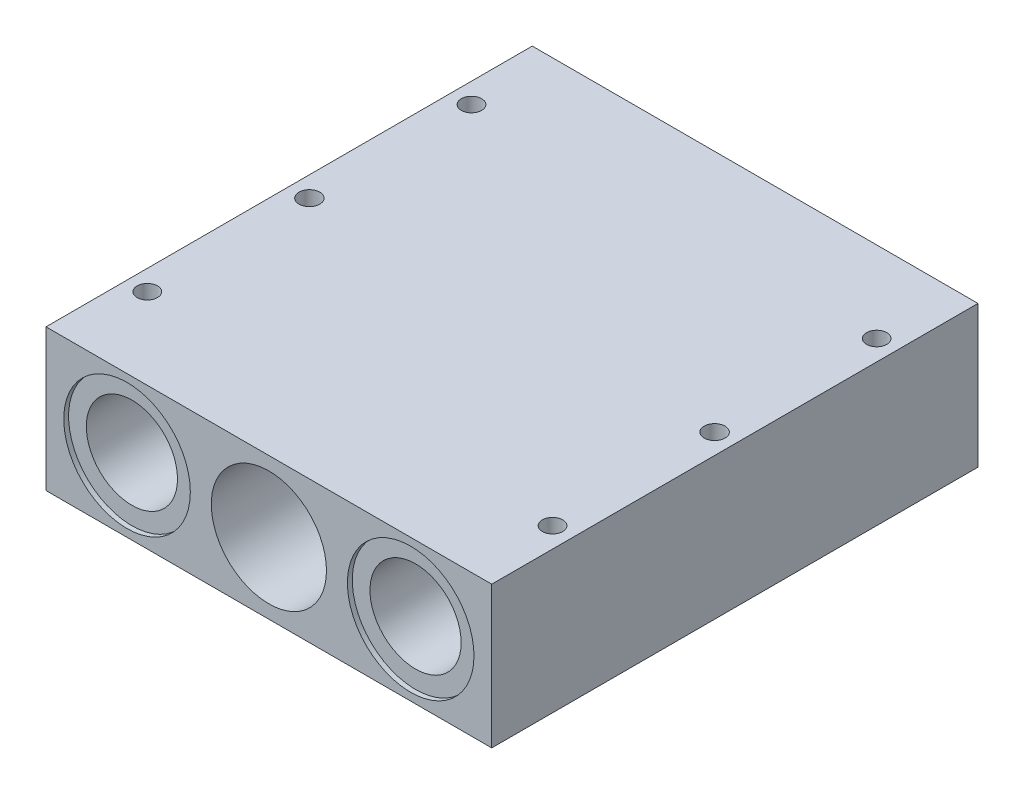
from build123d import *

# Parameters (mm, degrees)
SKETCH1_W                        = 139.7
SKETCH1_H                        = 152.4
EXTRUDE1_DEPTH                   = 22.225
SKETCH2_R                        = 14.2875
CUT_EXTRUDE1_DEPTH               = 170.111599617
SKETCH3_R                        = 19.8374
CUT_EXTRUDE2_DEPTH               = 1.524
CUT_EXTRUDE3_START               = -1.524
SKETCH4_R                        = 19.8374
CUT_EXTRUDE3_DEPTH               = 1.524
SKETCH5_R                        = 18.0467
CUT_EXTRUDE4_DEPTH               = 170.111599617
F_5_16_18_MOUNTING_HOLES_D       = 6.5278
F_1_4_DOWEL_HOLES_SLIP_FIT_D     = 6.3754
F_1_4_DOWEL_HOLES_SLIP_FIT_DEPTH = 6.35


with BuildPart() as part:
    # Sketch1 → Extrude1 (new, symmetric)
    with BuildSketch(Plane(origin=(0, 0, 0), x_dir=(1, 0, 0), z_dir=(0, 1, 0))):
        Rectangle(SKETCH1_W, SKETCH1_H)
    extrude(amount=EXTRUDE1_DEPTH, both=True)

    # Sketch2 → Cut-Extrude1 (cut, through all)
    with BuildSketch(Plane.XY.offset(76.2)):
        with Locations((44.45, 0)):
            Circle(SKETCH2_R)
        with Locations((-44.45, 0)):
            Circle(SKETCH2_R)
    extrude(amount=-CUT_EXTRUDE1_DEPTH, mode=Mode.SUBTRACT)

    # Sketch3 → Cut-Extrude2 (cut)
    with BuildSketch(Plane.XY.offset(76.2)):
        with Locations((44.45, 0)):
            Circle(SKETCH3_R)
        with Locations((-44.45, 0)):
            Circle(SKETCH3_R)
    extrude(amount=-CUT_EXTRUDE2_DEPTH, mode=Mode.SUBTRACT)

    # Sketch4 → Cut-Extrude3 (cut)
    with BuildSketch(Plane(origin=(0, 0, -76.2), x_dir=(-1, 0, 0), z_dir=(0, 0, -1)).offset(CUT_EXTRUDE3_START)):
        with Locations(Location((44.45, 0, 0), (0, 0, 180))):
            Circle(SKETCH4_R)
        with Locations(Location((-44.45, 0, 0), (0, 0, 180))):
            Circle(SKETCH4_R)
    extrude(amount=CUT_EXTRUDE3_DEPTH, mode=Mode.SUBTRACT)

    # Sketch5 → Cut-Extrude4 (cut, through all)
    with BuildSketch(Plane.XY.offset(76.2)):
        Circle(SKETCH5_R)
    extrude(amount=-CUT_EXTRUDE4_DEPTH, mode=Mode.SUBTRACT)

    # 5_16-18 _Mounting Holes (through all)
    with Locations(Plane(origin=(0, 22.225, 0), x_dir=(-1, 0, 0), z_dir=(0, 1, 0))):
        with Locations((63.5, 0), (-63.5, 0)):
            Hole(F_5_16_18_MOUNTING_HOLES_D / 2)

    # 1_4 Dowel Holes - Slip Fit
    with Locations(Plane(origin=(0, 22.225, 0), x_dir=(-1, 0, 0), z_dir=(0, 1, 0))):
        with Locations((63.5, 50.8), (63.5, -50.8), (-63.5, -50.8), (-63.5, 50.8)):
            Hole(F_1_4_DOWEL_HOLES_SLIP_FIT_D / 2, depth=F_1_4_DOWEL_HOLES_SLIP_FIT_DEPTH)


solid = part.part
